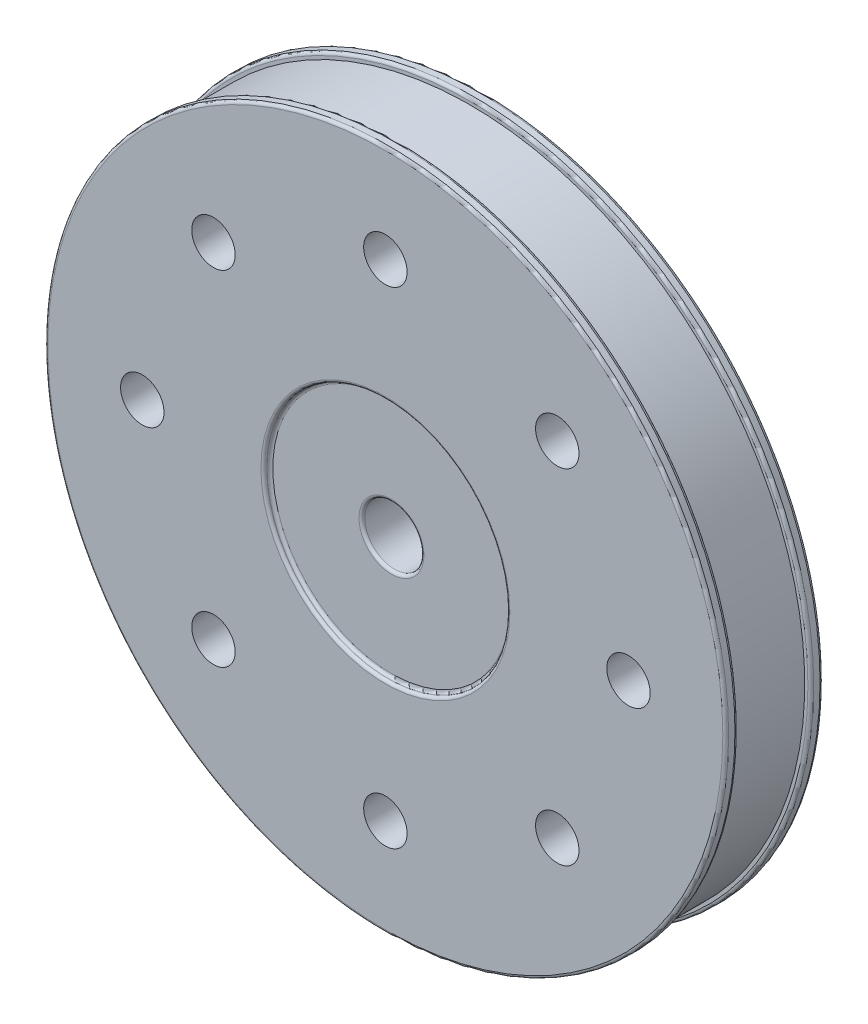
from build123d import *

# Parameters (mm, degrees)
SKETCH2_R          = 7.717952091
CUT_EXTRUDE1_DEPTH = 133.829266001
FILLET1_R          = 0.762
SKETCH3_R          = 5.672748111
CUT_EXTRUDE2_DEPTH = 134.35
CIRPATTERN1_COUNT  = 8


with BuildPart() as part:
    # Sketch1 → Revolve1 (revolve)
    with BuildSketch(Plane(origin=(0, 0, 0), x_dir=(0, 0, -1), z_dir=(1, 0, 0)), mode=Mode.PRIVATE) as revolve1_sk:
        Polygon((-44.45, 31.75), (-44.45, 88.9), (-41.275, 88.9), (-41.275, 87.3125), (-22.225, 87.3125), (-22.225, 88.9), (-19.05, 88.9), (-19.05, 31.75), (-20.6375, 31.75), (-20.6375, 14.2875), (0, 14.2875), (0, 0), (-42.8625, 0), (-42.8625, 31.75), align=None)
    revolve(revolve1_sk.sketch.rotate(Axis((0, 0, 0), (0, 0, 1)), 90), axis=Axis((0, 0, 0), (0, 0, 1)))

    # Sketch2 → Cut-Extrude1 (cut, through all)
    with BuildSketch(Plane.XY.offset(42.8625)):
        Circle(SKETCH2_R)
    extrude(amount=-CUT_EXTRUDE1_DEPTH, mode=Mode.SUBTRACT)

    # Fillet1
    fillet1_edges = [part.edges().sort_by_distance(p)[0] for p in [
        (88.9, 0, 22.225),
        (88.9, 0, 19.05),
        (-7.717952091, 0, 42.8625),
        (31.75, 0, 42.8625),
        (31.75, 0, 44.45),
        (88.9, 0, 44.45),
        (88.9, 0, 41.275),
    ]]
    fillet(fillet1_edges, radius=FILLET1_R)

    # Sketch3 → Cut-Extrude2 (cut, through all)
    with BuildSketch(Plane.XY.offset(44.45)):
        with Locations((0, 63.5)):
            Circle(SKETCH3_R)
    cut_extrude2 = extrude(amount=-CUT_EXTRUDE2_DEPTH, mode=Mode.SUBTRACT)

    # CirPattern1: Cut-Extrude2 ×8 about axis
    cirpattern1_axis = Axis((0, 0, 0), (0, 0, 1))
    for i in range(1, CIRPATTERN1_COUNT):
        add(cut_extrude2.rotate(cirpattern1_axis, i * 360 / CIRPATTERN1_COUNT), mode=Mode.SUBTRACT)


solid = part.part
